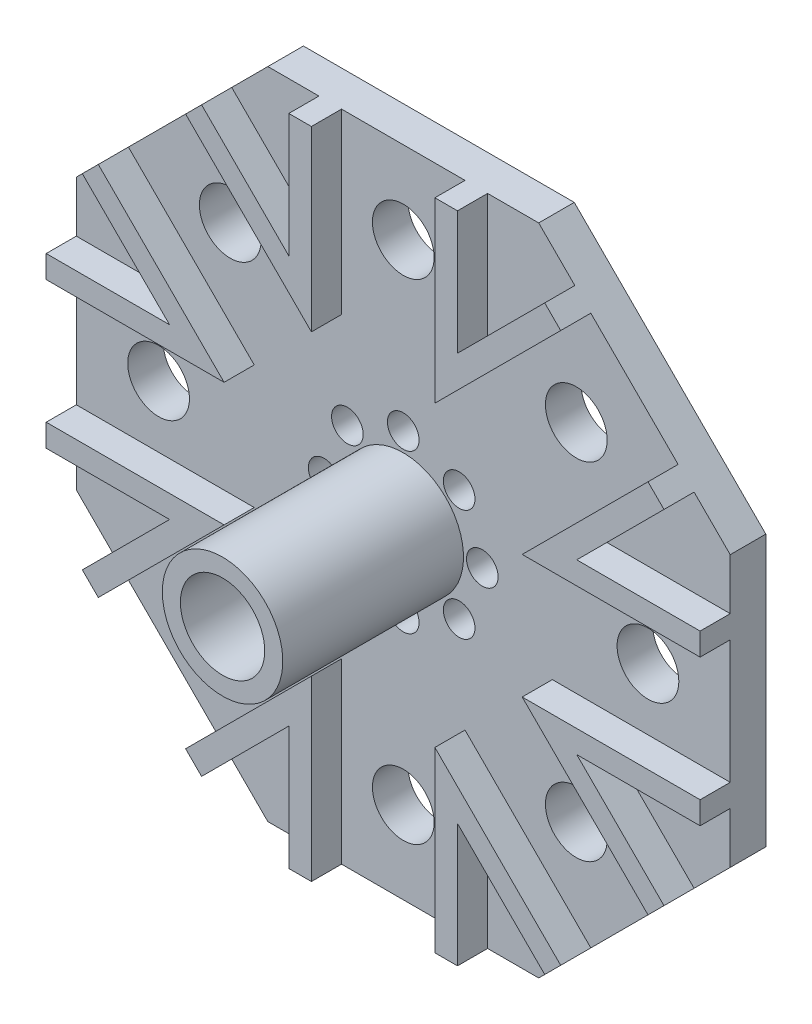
from build123d import *

# Parameters (mm, degrees)
BOSS_EXTRUDE1_DEPTH     = 3
SKETCH2_R               = 5.08
SKETCH2_R_2             = 3.556
BOSS_EXTRUDE2_DEPTH     = 15.24
SKETCH3_R               = 1.3335
CUT_EXTRUDE1_DEPTH      = 2.2
SKETCH4_R               = 2.6035
CUT_EXTRUDE2_DEPTH      = 16.637
BOSS_EXTRUDE3_DEPTH     = 2.54
SKETCH6_W               = 55.15
SKETCH6_H               = 3
BOSS_EXTRUDE4_DEPTH     = 26.6
CUT_EXTRUDE3_DEPTH      = 51.424202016
SKETCH8_R               = 2.6035
CUT_EXTRUDE4_DEPTH      = 51.424202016
BOSS_EXTRUDE5_DEPTH     = 2.54
BOSS_EXTRUDE6_DEPTH     = 3
SKETCH4_2_R             = 2.6035
CUT_EXTRUDE5_DEPTH      = 57.18987342
CUT_EXTRUDE6_DEPTH      = 53.424156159
CUT_EXTRUDE6_DEPTH_BACK = 53.424156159


with BuildPart() as part:
    # Sketch1 → Boss-Extrude1 (new body)
    with BuildSketch(Plane.XY):
        Polygon((-27.575, 0), (27.575, 0), (27.575, 22.843877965), (11.421938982, 38.996938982), (-11.421938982, 38.996938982), (-27.575, 22.843877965), align=None)
    extrude(amount=BOSS_EXTRUDE1_DEPTH)

    # Sketch2 → Boss-Extrude2 (add)
    with BuildSketch(Plane.XY.offset(3)):
        with Locations(Location((0, 11.421938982, 0), (0, 0, 180))):
            Circle(SKETCH2_R)
        with Locations(Location((0, 11.421938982, 0), (0, 0, 180))):
            Circle(SKETCH2_R_2, mode=Mode.SUBTRACT)
    extrude(amount=BOSS_EXTRUDE2_DEPTH)

    # Sketch3 → Cut-Extrude1 (cut)
    with BuildSketch(Plane.XY.offset(3)):
        with Locations((6.666427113, 11.421938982)):
            Circle(SKETCH3_R)
        with Locations((4.713875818, 6.708063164)):
            Circle(SKETCH3_R)
        with Locations((0, 4.755511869)):
            Circle(SKETCH3_R)
        with Locations((-4.713875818, 6.708063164)):
            Circle(SKETCH3_R)
        with Locations((-6.666427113, 11.421938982)):
            Circle(SKETCH3_R)
        with Locations((-4.713875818, 16.1358148)):
            Circle(SKETCH3_R)
        with Locations((0, 18.088366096)):
            Circle(SKETCH3_R)
        with Locations((4.713875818, 16.1358148)):
            Circle(SKETCH3_R)
    extrude(amount=-CUT_EXTRUDE1_DEPTH, mode=Mode.SUBTRACT)

    # Sketch4 → Cut-Extrude2 (cut)
    with BuildSketch(Plane.XY.offset(3)):
        with Locations((20.636427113, 11.421938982)):
            Circle(SKETCH4_R)
        with Locations((14.592157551, -3.170218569)):
            Circle(SKETCH4_R)
        with Locations((0, -9.214488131)):
            Circle(SKETCH4_R)
        with Locations((-14.592157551, -3.170218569)):
            Circle(SKETCH4_R)
        with Locations((-20.636427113, 11.421938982)):
            Circle(SKETCH4_R)
        with Locations((-14.592157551, 26.014096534)):
            Circle(SKETCH4_R)
        with Locations((0, 32.058366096)):
            Circle(SKETCH4_R)
        with Locations((14.592157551, 26.014096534)):
            Circle(SKETCH4_R)
    extrude(amount=-CUT_EXTRUDE2_DEPTH, mode=Mode.SUBTRACT)

    # Sketch5 → Boss-Extrude3 (add)
    with BuildSketch(Plane.XY.offset(3)):
        Polygon((5.207, 38.996938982), (5.207, 23.992749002), (15.816564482, 34.602313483), (14.469526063, 35.949351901), (7.112, 28.591825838), (7.112, 38.996938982), align=None)
        Polygon((23.180374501, 27.238503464), (12.570810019, 16.628938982), (27.575, 16.628938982), (27.575, 18.533938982), (17.169886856, 18.533938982), (24.527412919, 25.891465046), align=None)
        Polygon((27.575, 6.214938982), (12.570810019, 6.214938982), (23.180374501, -4.394625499), (24.527412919, -3.047587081), (17.169886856, 4.309938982), (27.575, 4.309938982), align=None)
        Polygon((15.816564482, -11.758435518), (5.207, -1.148871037), (5.207, -16.153061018), (7.112, -16.153061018), (7.112, -5.747947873), (14.469526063, -13.105473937), align=None)
        Polygon((-5.207, -16.153061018), (-5.207, -1.148871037), (-15.816564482, -11.758435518), (-14.469526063, -13.105473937), (-7.112, -5.747947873), (-7.112, -16.153061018), align=None)
        Polygon((-23.180374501, -4.394625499), (-12.570810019, 6.214938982), (-27.575, 6.214938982), (-27.575, 4.309938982), (-17.169886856, 4.309938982), (-24.527412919, -3.047587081), align=None)
        Polygon((-27.575, 16.628938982), (-12.570810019, 16.628938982), (-23.180374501, 27.238503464), (-24.527412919, 25.891465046), (-17.169886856, 18.533938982), (-27.575, 18.533938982), align=None)
        Polygon((-15.816564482, 34.602313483), (-5.207, 23.992749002), (-5.207, 38.996938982), (-7.112, 38.996938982), (-7.112, 28.591825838), (-14.469526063, 35.949351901), align=None)
    extrude(amount=BOSS_EXTRUDE3_DEPTH)


with BuildPart() as boss_extrude3_piece_1:
    # of the separate pieces the step leaves, piece 1, a body of its own (boss_extrude3_pieces)
    add(part.part.solids().sort_by_distance((-27.575, 0, 0))[0])

    # Sketch6 → Boss-Extrude4 (add)
    with BuildSketch(Plane(origin=(0, 0, 0), x_dir=(-1, 0, 0), z_dir=(0, 0, -1))):
        with Locations((0, 18.128938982)):
            Rectangle(SKETCH6_W, SKETCH6_H)
    extrude(amount=BOSS_EXTRUDE4_DEPTH)

    # Sketch7 → Cut-Extrude3 (cut, through all)
    with BuildSketch(Plane.XZ.offset(-16.628938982)):
        Polygon((-11.421938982, -26.6), (-27.575, -10.446938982), (-27.575, -26.6), align=None)
        Polygon((27.575, -10.446938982), (11.421938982, -26.6), (27.575, -26.6), align=None)
    extrude(amount=-CUT_EXTRUDE3_DEPTH, mode=Mode.SUBTRACT)

    # Sketch8 → Cut-Extrude4 (cut, through all)
    with BuildSketch(Plane.XZ.offset(-16.628938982)):
        with Locations(Location((-14.206721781, -13.231721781, 0), (0, 0, 270))):
            Circle(SKETCH8_R)
        with Locations(Location((0, -19.11633862, 0), (0, 0, 270))):
            Circle(SKETCH8_R)
        with Locations(Location((14.206721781, -13.231721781, 0), (0, 0, 270))):
            Circle(SKETCH8_R)
    extrude(amount=-CUT_EXTRUDE4_DEPTH, mode=Mode.SUBTRACT)

    # Sketch9 → Boss-Extrude5 (add)
    with BuildSketch(Plane.XZ.offset(-16.628938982)):
        Polygon((5.207, -26.6), (5.207, -11.595810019), (15.816564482, -22.205374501), (14.579127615, -23.442811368), (6.957, -15.820683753), (6.957, -26.6), align=None)
        Polygon((-14.579127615, -23.442811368), (-6.957, -15.820683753), (-6.957, -26.6), (-5.207, -26.6), (-5.207, -11.595810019), (-15.816564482, -22.205374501), align=None)
        Polygon((-12.570810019, -4.232), (-13.808246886, -2.994563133), (-16.795683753, -5.982), (-24.417811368, -13.604127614), (-23.180374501, -14.841564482), align=None)
        Polygon((12.570810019, -4.232), (13.808246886, -2.994563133), (16.795683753, -5.982), (24.417811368, -13.604127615), (23.180374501, -14.841564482), align=None)
    extrude(amount=BOSS_EXTRUDE5_DEPTH)

    # Sketch12 → Boss-Extrude6 (add)
    with BuildSketch(Plane.XY.offset(3)):
        Polygon((27.575, 0), (-27.575, 0), (-11.42193898, -16.153061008), (11.42193898, -16.153061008), align=None)
    extrude(amount=-BOSS_EXTRUDE6_DEPTH)

    # Sketch4_2 → Cut-Extrude5 (cut, through all)
    with BuildSketch(Plane.XY.offset(3)):
        with Locations((-14.592157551, -3.170218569)):
            Circle(SKETCH4_2_R)
        with Locations((0, -9.214488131)):
            Circle(SKETCH4_2_R)
        with Locations((14.592157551, -3.170218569)):
            Circle(SKETCH4_2_R)
    extrude(amount=-CUT_EXTRUDE5_DEPTH, mode=Mode.SUBTRACT)

    # Sketch13 → Cut-Extrude6 (cut, two sides: drawn at the far end of the back side and taken through both)
    with BuildSketch(Plane(origin=(0, 19.628938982, 0), x_dir=(1, 0, 0), z_dir=(0, 1, 0)).offset(-CUT_EXTRUDE6_DEPTH_BACK)):
        Polygon((27.575, 10.446938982), (11.421938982, 26.6), (-11.421938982, 26.6), (-27.575, 10.446938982), (-27.575, 0), (27.575, 0), align=None)
    extrude(amount=CUT_EXTRUDE6_DEPTH + CUT_EXTRUDE6_DEPTH_BACK, mode=Mode.SUBTRACT)


with BuildPart() as boss_extrude3_piece_2:
    # of the separate pieces the step leaves, piece 2, a body of its own (boss_extrude3_pieces)
    add(part.part.solids().sort_by_distance((15.816564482, -11.758435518, 3))[0])


with BuildPart() as boss_extrude3_piece_3:
    # of the separate pieces the step leaves, piece 3, a body of its own (boss_extrude3_pieces)
    add(part.part.solids().sort_by_distance((-5.207, -16.153061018, 3))[0])


solid = Compound([boss_extrude3_piece_1.part, boss_extrude3_piece_2.part, boss_extrude3_piece_3.part])
